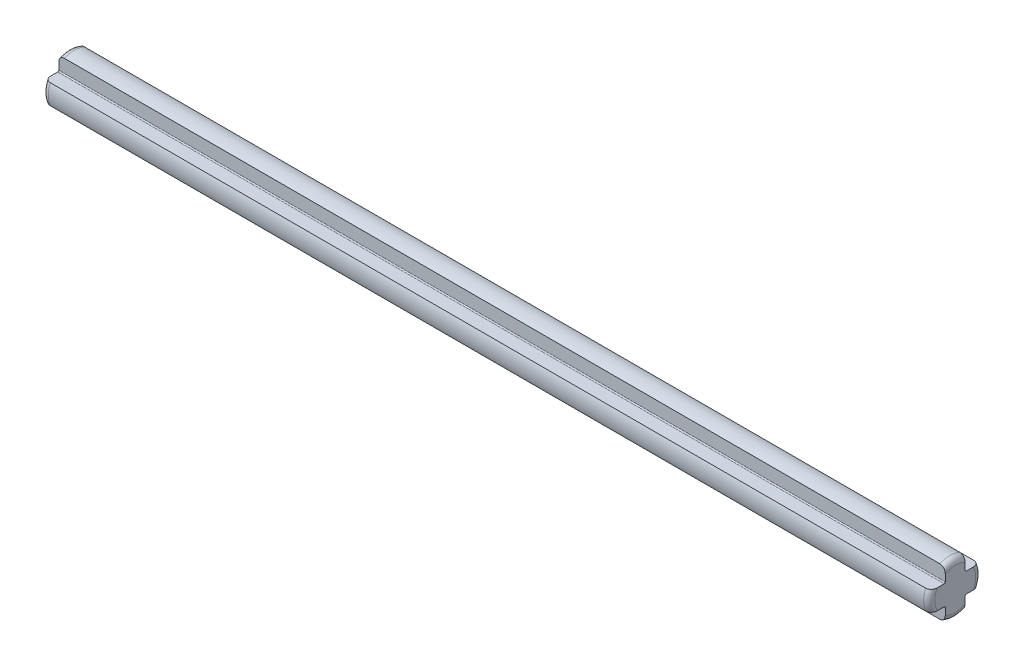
ISO-10303-21;
HEADER;
FILE_DESCRIPTION(('STEP AP214'),'2;1');
FILE_NAME('part.step','',(''),(''),'','','');
FILE_SCHEMA(('AUTOMOTIVE_DESIGN { 1 0 10303 214 1 1 1 1 }'));
ENDSEC;
DATA;
#1=APPLICATION_CONTEXT('core data for automotive mechanical design processes');
#2=APPLICATION_PROTOCOL_DEFINITION('international standard','automotive_design',2000,#1);
#3=PRODUCT_CONTEXT('',#1,'mechanical');
#4=PRODUCT('Part','Part','',(#3));
#5=PRODUCT_RELATED_PRODUCT_CATEGORY('part','',(#4));
#6=PRODUCT_DEFINITION_FORMATION('','',#4);
#7=PRODUCT_DEFINITION_CONTEXT('part definition',#1,'design');
#8=PRODUCT_DEFINITION('design','',#6,#7);
#9=PRODUCT_DEFINITION_SHAPE('','',#8);
#10=(LENGTH_UNIT() NAMED_UNIT(*) SI_UNIT(.MILLI.,.METRE.));
#11=(NAMED_UNIT(*) PLANE_ANGLE_UNIT() SI_UNIT($,.RADIAN.));
#12=(NAMED_UNIT(*) SI_UNIT($,.STERADIAN.) SOLID_ANGLE_UNIT());
#13=UNCERTAINTY_MEASURE_WITH_UNIT(LENGTH_MEASURE(1.E-05),#10,'distance_accuracy_value','');
#14=(GEOMETRIC_REPRESENTATION_CONTEXT(3) GLOBAL_UNCERTAINTY_ASSIGNED_CONTEXT((#13)) GLOBAL_UNIT_ASSIGNED_CONTEXT((#10,
#11,#12)) REPRESENTATION_CONTEXT('',''));
#15=CARTESIAN_POINT('',(0.,0.,0.));
#16=DIRECTION('',(0.,0.,1.));
#17=DIRECTION('',(1.,0.,0.));
#18=AXIS2_PLACEMENT_3D('',#15,#16,#17);
#19=CARTESIAN_POINT('',(40.,0.,0.));
#20=DIRECTION('',(-1.,0.,0.));
#21=DIRECTION('',(0.,0.,1.));
#22=AXIS2_PLACEMENT_3D('',#19,#20,#21);
#23=CYLINDRICAL_SURFACE('',#22,2.35);
#24=DIRECTION('',(-1.,0.,0.));
#25=VECTOR('',#24,1.);
#26=CARTESIAN_POINT('',(40.,0.9,2.17082933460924));
#27=LINE('',#26,#25);
#28=CARTESIAN_POINT('',(39.5,0.9,2.17082933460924));
#29=VERTEX_POINT('',#28);
#30=CARTESIAN_POINT('',(-39.5,0.9,2.17082933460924));
#31=VERTEX_POINT('',#30);
#32=EDGE_CURVE('E249',#29,#31,#27,.T.);
#33=ORIENTED_EDGE('',*,*,#32,.T.);
#34=CARTESIAN_POINT('',(-39.5,0.,0.));
#35=DIRECTION('',(1.,0.,0.));
#36=DIRECTION('',(0.,0.,-1.));
#37=AXIS2_PLACEMENT_3D('',#34,#35,#36);
#38=CIRCLE('',#37,2.35);
#39=CARTESIAN_POINT('',(-39.5,-0.900000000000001,2.17082933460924));
#40=VERTEX_POINT('',#39);
#41=EDGE_CURVE('E514',#31,#40,#38,.T.);
#42=ORIENTED_EDGE('',*,*,#41,.T.);
#43=DIRECTION('',(-1.,0.,0.));
#44=VECTOR('',#43,1.);
#45=CARTESIAN_POINT('',(40.,-0.900000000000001,2.17082933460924));
#46=LINE('',#45,#44);
#47=CARTESIAN_POINT('',(39.5,-0.900000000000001,2.17082933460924));
#48=VERTEX_POINT('',#47);
#49=EDGE_CURVE('E220',#48,#40,#46,.T.);
#50=ORIENTED_EDGE('',*,*,#49,.F.);
#51=CARTESIAN_POINT('',(39.5,0.,0.));
#52=DIRECTION('',(1.,0.,0.));
#53=DIRECTION('',(0.,0.,-1.));
#54=AXIS2_PLACEMENT_3D('',#51,#52,#53);
#55=CIRCLE('',#54,2.35);
#56=EDGE_CURVE('E369',#48,#29,#55,.F.);
#57=ORIENTED_EDGE('',*,*,#56,.T.);
#58=EDGE_LOOP('',(#33,#42,#50,#57));
#59=FACE_BOUND('',#58,.T.);
#60=ADVANCED_FACE('F36',(#59),#23,.T.);
#61=CARTESIAN_POINT('',(40.,-0.900000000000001,2.17082933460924));
#62=DIRECTION('',(0.,1.,0.));
#63=DIRECTION('',(0.,0.,1.));
#64=AXIS2_PLACEMENT_3D('',#61,#62,#63);
#65=PLANE('',#64);
#66=ORIENTED_EDGE('',*,*,#49,.T.);
#67=CARTESIAN_POINT('',(-39.5,-0.900000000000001,2.17082933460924));
#68=CARTESIAN_POINT('',(-39.5264833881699,-0.900000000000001,2.17085986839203));
#69=CARTESIAN_POINT('',(-39.5529498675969,-0.900000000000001,2.16855372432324));
#70=CARTESIAN_POINT('',(-39.6050453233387,-0.900000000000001,2.15950506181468));
#71=CARTESIAN_POINT('',(-39.6306762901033,-0.900000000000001,2.15277404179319));
#72=CARTESIAN_POINT('',(-39.6804387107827,-0.900000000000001,2.1351114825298));
#73=CARTESIAN_POINT('',(-39.7045703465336,-0.900000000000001,2.12418045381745));
#74=CARTESIAN_POINT('',(-39.7507251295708,-0.900000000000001,2.09852306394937));
#75=CARTESIAN_POINT('',(-39.7727475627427,-0.900000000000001,2.0837954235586));
#76=CARTESIAN_POINT('',(-39.8147234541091,-0.900000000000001,2.05060839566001));
#77=CARTESIAN_POINT('',(-39.8346070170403,-0.900000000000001,2.03206082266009));
#78=CARTESIAN_POINT('',(-39.8712243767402,-0.900000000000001,1.99209288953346));
#79=CARTESIAN_POINT('',(-39.8879579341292,-0.900000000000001,1.97067231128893));
#80=CARTESIAN_POINT('',(-39.9190973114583,-0.900000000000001,1.92396602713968));
#81=CARTESIAN_POINT('',(-39.9332527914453,-0.900000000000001,1.89851375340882));
#82=CARTESIAN_POINT('',(-39.9575247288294,-0.900000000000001,1.84573102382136));
#83=CARTESIAN_POINT('',(-39.9676367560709,-0.900000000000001,1.81839854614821));
#84=CARTESIAN_POINT('',(-39.9838866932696,-0.900000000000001,1.76219756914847));
#85=CARTESIAN_POINT('',(-39.9899702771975,-0.900000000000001,1.73331353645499));
#86=CARTESIAN_POINT('',(-39.9980270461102,-0.900000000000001,1.67505065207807));
#87=CARTESIAN_POINT('',(-40.0000109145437,-0.900000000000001,1.64567328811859));
#88=CARTESIAN_POINT('',(-40.,-0.900000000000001,1.61632298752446));
#89=B_SPLINE_CURVE_WITH_KNOTS('',3,(#67,#68,#69,#70,#71,#72,#73,#74,#75,#76,#77,#78,#79,#80,#81,
#82,#83,#84,#85,#86,#87,#88),.UNSPECIFIED.,.F.,.F.,(4,2,2,2,2,2,2,2,2,2,4),(0.,
0.0793238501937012,0.158442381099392,0.237551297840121,0.316686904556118,0.397909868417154,
0.479139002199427,0.566147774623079,0.653251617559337,0.74150740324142,0.829532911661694),.UNSPECIFIED.);
#90=CARTESIAN_POINT('',(-40.,-0.900000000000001,1.61632298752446));
#91=VERTEX_POINT('',#90);
#92=EDGE_CURVE('E389',#40,#91,#89,.T.);
#93=ORIENTED_EDGE('',*,*,#92,.T.);
#94=DIRECTION('',(0.,0.,-1.));
#95=VECTOR('',#94,1.);
#96=CARTESIAN_POINT('',(-40.,-0.900000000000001,2.17082933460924));
#97=LINE('',#96,#95);
#98=CARTESIAN_POINT('',(-40.,-0.900000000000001,0.999999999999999));
#99=VERTEX_POINT('',#98);
#100=EDGE_CURVE('E217',#91,#99,#97,.T.);
#101=ORIENTED_EDGE('',*,*,#100,.T.);
#102=DIRECTION('',(-1.,0.,0.));
#103=VECTOR('',#102,1.);
#104=CARTESIAN_POINT('',(40.,-0.900000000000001,0.999999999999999));
#105=LINE('',#104,#103);
#106=CARTESIAN_POINT('',(40.,-0.900000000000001,0.999999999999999));
#107=VERTEX_POINT('',#106);
#108=EDGE_CURVE('E213',#107,#99,#105,.T.);
#109=ORIENTED_EDGE('',*,*,#108,.F.);
#110=DIRECTION('',(0.,0.,-1.));
#111=VECTOR('',#110,1.);
#112=CARTESIAN_POINT('',(40.,-0.900000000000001,2.17082933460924));
#113=LINE('',#112,#111);
#114=CARTESIAN_POINT('',(40.,-0.900000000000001,1.61632298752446));
#115=VERTEX_POINT('',#114);
#116=EDGE_CURVE('E200',#115,#107,#113,.T.);
#117=ORIENTED_EDGE('',*,*,#116,.F.);
#118=CARTESIAN_POINT('',(40.,-0.900000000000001,1.61632298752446));
#119=CARTESIAN_POINT('',(40.0000222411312,-0.900000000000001,1.65066661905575));
#120=CARTESIAN_POINT('',(39.9972983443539,-0.900000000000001,1.68506058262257));
#121=CARTESIAN_POINT('',(39.9862156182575,-0.900000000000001,1.75308687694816));
#122=CARTESIAN_POINT('',(39.9778303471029,-0.900000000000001,1.78671486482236));
#123=CARTESIAN_POINT('',(39.9552419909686,-0.900000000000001,1.85211366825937));
#124=CARTESIAN_POINT('',(39.9410195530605,-0.900000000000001,1.88387790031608));
#125=CARTESIAN_POINT('',(39.9069131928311,-0.900000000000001,1.94414749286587));
#126=CARTESIAN_POINT('',(39.8870416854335,-0.900000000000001,1.97265980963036));
#127=CARTESIAN_POINT('',(39.844222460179,-0.900000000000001,2.02268935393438));
#128=CARTESIAN_POINT('',(39.8217526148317,-0.900000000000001,2.04461521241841));
#129=CARTESIAN_POINT('',(39.7730890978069,-0.900000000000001,2.08389547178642));
#130=CARTESIAN_POINT('',(39.7468952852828,-0.900000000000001,2.10124969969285));
#131=CARTESIAN_POINT('',(39.6943438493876,-0.900000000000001,2.12912089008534));
#132=CARTESIAN_POINT('',(39.6682509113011,-0.900000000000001,2.14013932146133));
#133=CARTESIAN_POINT('',(39.6145341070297,-0.900000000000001,2.15730052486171));
#134=CARTESIAN_POINT('',(39.586913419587,-0.900000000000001,2.1634530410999));
#135=CARTESIAN_POINT('',(39.5492135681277,-0.900000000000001,2.16830749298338));
#136=CARTESIAN_POINT('',(39.5393866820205,-0.900000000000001,2.1692533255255));
#137=CARTESIAN_POINT('',(39.5197081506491,-0.900000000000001,2.17051341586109));
#138=CARTESIAN_POINT('',(39.5098565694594,-0.900000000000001,2.17082867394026));
#139=CARTESIAN_POINT('',(39.5,-0.900000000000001,2.17082933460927));
#140=B_SPLINE_CURVE_WITH_KNOTS('',3,(#118,#119,#120,#121,#122,#123,#124,#125,#126,#127,#128,
#129,#130,#131,#132,#133,#134,#135,#136,#137,#138,#139),.UNSPECIFIED.,.F.,.F.,(4,2,2,2,2,2,2,2,
2,2,4),(0.,0.103000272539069,0.206484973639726,0.310315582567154,0.413919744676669,
0.507586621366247,0.601257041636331,0.685799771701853,0.770172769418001,0.799774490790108,
0.829329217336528),.UNSPECIFIED.);
#141=EDGE_CURVE('E519',#115,#48,#140,.T.);
#142=ORIENTED_EDGE('',*,*,#141,.T.);
#143=EDGE_LOOP('',(#66,#93,#101,#109,#117,#142));
#144=FACE_BOUND('',#143,.T.);
#145=ADVANCED_FACE('F215',(#144),#65,.F.);
#146=CARTESIAN_POINT('',(40.,-1.,0.999999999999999));
#147=DIRECTION('',(-1.,0.,0.));
#148=DIRECTION('',(0.,0.,1.));
#149=AXIS2_PLACEMENT_3D('',#146,#147,#148);
#150=CYLINDRICAL_SURFACE('',#149,0.0999999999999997);
#151=CARTESIAN_POINT('',(-40.,-1.,0.999999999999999));
#152=DIRECTION('',(-1.,0.,0.));
#153=DIRECTION('',(0.,0.,1.));
#154=AXIS2_PLACEMENT_3D('',#151,#152,#153);
#155=CIRCLE('',#154,0.0999999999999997);
#156=CARTESIAN_POINT('',(-40.,-1.,0.899999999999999));
#157=VERTEX_POINT('',#156);
#158=EDGE_CURVE('E251',#99,#157,#155,.T.);
#159=ORIENTED_EDGE('',*,*,#158,.T.);
#160=DIRECTION('',(-1.,0.,0.));
#161=VECTOR('',#160,1.);
#162=CARTESIAN_POINT('',(40.,-1.,0.899999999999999));
#163=LINE('',#162,#161);
#164=CARTESIAN_POINT('',(40.,-1.,0.899999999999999));
#165=VERTEX_POINT('',#164);
#166=EDGE_CURVE('E221',#165,#157,#163,.T.);
#167=ORIENTED_EDGE('',*,*,#166,.F.);
#168=CARTESIAN_POINT('',(40.,-1.,0.999999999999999));
#169=DIRECTION('',(-1.,0.,0.));
#170=DIRECTION('',(0.,0.,1.));
#171=AXIS2_PLACEMENT_3D('',#168,#169,#170);
#172=CIRCLE('',#171,0.0999999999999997);
#173=EDGE_CURVE('E206',#107,#165,#172,.T.);
#174=ORIENTED_EDGE('',*,*,#173,.F.);
#175=ORIENTED_EDGE('',*,*,#108,.T.);
#176=EDGE_LOOP('',(#159,#167,#174,#175));
#177=FACE_BOUND('',#176,.T.);
#178=ADVANCED_FACE('F223',(#177),#150,.F.);
#179=CARTESIAN_POINT('',(40.,-2.17082933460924,0.899999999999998));
#180=DIRECTION('',(0.,0.,-1.));
#181=DIRECTION('',(0.,1.,0.));
#182=AXIS2_PLACEMENT_3D('',#179,#180,#181);
#183=PLANE('',#182);
#184=DIRECTION('',(0.,-1.,0.));
#185=VECTOR('',#184,1.);
#186=CARTESIAN_POINT('',(-40.,-2.17082933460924,0.899999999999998));
#187=LINE('',#186,#185);
#188=CARTESIAN_POINT('',(-40.,-1.61632298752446,0.899999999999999));
#189=VERTEX_POINT('',#188);
#190=EDGE_CURVE('E253',#157,#189,#187,.T.);
#191=ORIENTED_EDGE('',*,*,#190,.T.);
#192=CARTESIAN_POINT('',(-40.,-1.61632298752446,0.899999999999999));
#193=CARTESIAN_POINT('',(-40.0000222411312,-1.65066661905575,0.899999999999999));
#194=CARTESIAN_POINT('',(-39.9972983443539,-1.68506058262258,0.899999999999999));
#195=CARTESIAN_POINT('',(-39.9862156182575,-1.75308687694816,0.899999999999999));
#196=CARTESIAN_POINT('',(-39.9778303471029,-1.78671486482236,0.899999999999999));
#197=CARTESIAN_POINT('',(-39.9552419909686,-1.85211366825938,0.899999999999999));
#198=CARTESIAN_POINT('',(-39.9410195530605,-1.88387790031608,0.899999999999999));
#199=CARTESIAN_POINT('',(-39.9069131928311,-1.94414749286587,0.899999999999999));
#200=CARTESIAN_POINT('',(-39.8870416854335,-1.97265980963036,0.899999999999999));
#201=CARTESIAN_POINT('',(-39.844222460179,-2.02268935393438,0.899999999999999));
#202=CARTESIAN_POINT('',(-39.8217526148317,-2.04461521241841,0.899999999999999));
#203=CARTESIAN_POINT('',(-39.7730890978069,-2.08389547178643,0.899999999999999));
#204=CARTESIAN_POINT('',(-39.7468952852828,-2.10124969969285,0.899999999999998));
#205=CARTESIAN_POINT('',(-39.6943438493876,-2.12912089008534,0.899999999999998));
#206=CARTESIAN_POINT('',(-39.6682509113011,-2.14013932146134,0.899999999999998));
#207=CARTESIAN_POINT('',(-39.6145341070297,-2.15730052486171,0.899999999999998));
#208=CARTESIAN_POINT('',(-39.586913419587,-2.1634530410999,0.899999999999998));
#209=CARTESIAN_POINT('',(-39.5492135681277,-2.16830749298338,0.899999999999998));
#210=CARTESIAN_POINT('',(-39.5393866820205,-2.1692533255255,0.899999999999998));
#211=CARTESIAN_POINT('',(-39.5197081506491,-2.17051341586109,0.899999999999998));
#212=CARTESIAN_POINT('',(-39.5098565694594,-2.17082867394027,0.899999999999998));
#213=CARTESIAN_POINT('',(-39.5,-2.17082933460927,0.899999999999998));
#214=B_SPLINE_CURVE_WITH_KNOTS('',3,(#192,#193,#194,#195,#196,#197,#198,#199,#200,#201,#202,
#203,#204,#205,#206,#207,#208,#209,#210,#211,#212,#213),.UNSPECIFIED.,.F.,.F.,(4,2,2,2,2,2,2,2,
2,2,4),(0.,0.10300027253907,0.206484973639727,0.310315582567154,0.413919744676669,
0.507586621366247,0.601257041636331,0.685799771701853,0.770172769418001,0.799774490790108,
0.829329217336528),.UNSPECIFIED.);
#215=CARTESIAN_POINT('',(-39.5,-2.17082933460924,0.899999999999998));
#216=VERTEX_POINT('',#215);
#217=EDGE_CURVE('E364',#189,#216,#214,.T.);
#218=ORIENTED_EDGE('',*,*,#217,.T.);
#219=DIRECTION('',(-1.,0.,0.));
#220=VECTOR('',#219,1.);
#221=CARTESIAN_POINT('',(40.,-2.17082933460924,0.899999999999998));
#222=LINE('',#221,#220);
#223=CARTESIAN_POINT('',(39.5,-2.17082933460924,0.899999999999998));
#224=VERTEX_POINT('',#223);
#225=EDGE_CURVE('E311',#224,#216,#222,.T.);
#226=ORIENTED_EDGE('',*,*,#225,.F.);
#227=CARTESIAN_POINT('',(39.5,-2.17082933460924,0.899999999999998));
#228=CARTESIAN_POINT('',(39.5264833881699,-2.17085986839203,0.899999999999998));
#229=CARTESIAN_POINT('',(39.5529498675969,-2.16855372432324,0.899999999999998));
#230=CARTESIAN_POINT('',(39.6050453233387,-2.15950506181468,0.899999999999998));
#231=CARTESIAN_POINT('',(39.6306762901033,-2.15277404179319,0.899999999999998));
#232=CARTESIAN_POINT('',(39.6804387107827,-2.1351114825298,0.899999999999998));
#233=CARTESIAN_POINT('',(39.7045703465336,-2.12418045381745,0.899999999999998));
#234=CARTESIAN_POINT('',(39.7507251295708,-2.09852306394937,0.899999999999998));
#235=CARTESIAN_POINT('',(39.7727475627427,-2.0837954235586,0.899999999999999));
#236=CARTESIAN_POINT('',(39.8147234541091,-2.05060839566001,0.899999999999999));
#237=CARTESIAN_POINT('',(39.8346070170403,-2.03206082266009,0.899999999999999));
#238=CARTESIAN_POINT('',(39.8712243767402,-1.99209288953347,0.899999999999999));
#239=CARTESIAN_POINT('',(39.8879579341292,-1.97067231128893,0.899999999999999));
#240=CARTESIAN_POINT('',(39.9190973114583,-1.92396602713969,0.899999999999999));
#241=CARTESIAN_POINT('',(39.9332527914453,-1.89851375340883,0.899999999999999));
#242=CARTESIAN_POINT('',(39.9575247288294,-1.84573102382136,0.899999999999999));
#243=CARTESIAN_POINT('',(39.9676367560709,-1.81839854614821,0.899999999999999));
#244=CARTESIAN_POINT('',(39.9838866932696,-1.76219756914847,0.899999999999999));
#245=CARTESIAN_POINT('',(39.9899702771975,-1.733313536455,0.899999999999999));
#246=CARTESIAN_POINT('',(39.9980270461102,-1.67505065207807,0.899999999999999));
#247=CARTESIAN_POINT('',(40.0000109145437,-1.64567328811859,0.899999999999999));
#248=CARTESIAN_POINT('',(40.,-1.61632298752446,0.899999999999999));
#249=B_SPLINE_CURVE_WITH_KNOTS('',3,(#227,#228,#229,#230,#231,#232,#233,#234,#235,#236,#237,
#238,#239,#240,#241,#242,#243,#244,#245,#246,#247,#248),.UNSPECIFIED.,.F.,.F.,(4,2,2,2,2,2,2,2,
2,2,4),(0.,0.0793238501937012,0.158442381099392,0.237551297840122,0.316686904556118,
0.397909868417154,0.479139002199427,0.566147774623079,0.653251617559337,0.74150740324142,
0.829532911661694),.UNSPECIFIED.);
#250=CARTESIAN_POINT('',(40.,-1.61632298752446,0.899999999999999));
#251=VERTEX_POINT('',#250);
#252=EDGE_CURVE('E358',#224,#251,#249,.T.);
#253=ORIENTED_EDGE('',*,*,#252,.T.);
#254=DIRECTION('',(0.,-1.,0.));
#255=VECTOR('',#254,1.);
#256=CARTESIAN_POINT('',(40.,-2.17082933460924,0.899999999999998));
#257=LINE('',#256,#255);
#258=EDGE_CURVE('E226',#165,#251,#257,.T.);
#259=ORIENTED_EDGE('',*,*,#258,.F.);
#260=ORIENTED_EDGE('',*,*,#166,.T.);
#261=EDGE_LOOP('',(#191,#218,#226,#253,#259,#260));
#262=FACE_BOUND('',#261,.T.);
#263=ADVANCED_FACE('F349',(#262),#183,.F.);
#264=CARTESIAN_POINT('',(40.,0.,0.));
#265=DIRECTION('',(-1.,0.,0.));
#266=DIRECTION('',(0.,0.,1.));
#267=AXIS2_PLACEMENT_3D('',#264,#265,#266);
#268=CYLINDRICAL_SURFACE('',#267,2.35);
#269=ORIENTED_EDGE('',*,*,#225,.T.);
#270=CARTESIAN_POINT('',(-39.5,0.,0.));
#271=DIRECTION('',(1.,0.,0.));
#272=DIRECTION('',(0.,0.,-1.));
#273=AXIS2_PLACEMENT_3D('',#270,#271,#272);
#274=CIRCLE('',#273,2.35);
#275=CARTESIAN_POINT('',(-39.5,-2.17082933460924,-0.9));
#276=VERTEX_POINT('',#275);
#277=EDGE_CURVE('E318',#216,#276,#274,.T.);
#278=ORIENTED_EDGE('',*,*,#277,.T.);
#279=DIRECTION('',(-1.,0.,0.));
#280=VECTOR('',#279,1.);
#281=CARTESIAN_POINT('',(40.,-2.17082933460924,-0.9));
#282=LINE('',#281,#280);
#283=CARTESIAN_POINT('',(39.5,-2.17082933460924,-0.9));
#284=VERTEX_POINT('',#283);
#285=EDGE_CURVE('E308',#284,#276,#282,.T.);
#286=ORIENTED_EDGE('',*,*,#285,.F.);
#287=CARTESIAN_POINT('',(39.5,0.,0.));
#288=DIRECTION('',(1.,0.,0.));
#289=DIRECTION('',(0.,0.,-1.));
#290=AXIS2_PLACEMENT_3D('',#287,#288,#289);
#291=CIRCLE('',#290,2.35);
#292=EDGE_CURVE('E316',#284,#224,#291,.F.);
#293=ORIENTED_EDGE('',*,*,#292,.T.);
#294=EDGE_LOOP('',(#269,#278,#286,#293));
#295=FACE_BOUND('',#294,.T.);
#296=ADVANCED_FACE('F343',(#295),#268,.T.);
#297=CARTESIAN_POINT('',(40.,-2.17082933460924,-0.9));
#298=DIRECTION('',(0.,0.,1.));
#299=DIRECTION('',(0.,-1.,0.));
#300=AXIS2_PLACEMENT_3D('',#297,#298,#299);
#301=PLANE('',#300);
#302=ORIENTED_EDGE('',*,*,#285,.T.);
#303=CARTESIAN_POINT('',(-39.5,-2.17082933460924,-0.9));
#304=CARTESIAN_POINT('',(-39.5264833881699,-2.17085986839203,-0.9));
#305=CARTESIAN_POINT('',(-39.5529498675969,-2.16855372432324,-0.9));
#306=CARTESIAN_POINT('',(-39.6050453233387,-2.15950506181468,-0.9));
#307=CARTESIAN_POINT('',(-39.6306762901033,-2.15277404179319,-0.9));
#308=CARTESIAN_POINT('',(-39.6804387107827,-2.1351114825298,-0.9));
#309=CARTESIAN_POINT('',(-39.7045703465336,-2.12418045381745,-0.9));
#310=CARTESIAN_POINT('',(-39.7507251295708,-2.09852306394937,-0.9));
#311=CARTESIAN_POINT('',(-39.7727475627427,-2.0837954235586,-0.9));
#312=CARTESIAN_POINT('',(-39.8147234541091,-2.05060839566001,-0.9));
#313=CARTESIAN_POINT('',(-39.8346070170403,-2.03206082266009,-0.9));
#314=CARTESIAN_POINT('',(-39.8712243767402,-1.99209288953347,-0.9));
#315=CARTESIAN_POINT('',(-39.8879579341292,-1.97067231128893,-0.9));
#316=CARTESIAN_POINT('',(-39.9190973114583,-1.92396602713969,-0.9));
#317=CARTESIAN_POINT('',(-39.9332527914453,-1.89851375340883,-0.9));
#318=CARTESIAN_POINT('',(-39.9575247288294,-1.84573102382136,-0.9));
#319=CARTESIAN_POINT('',(-39.9676367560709,-1.81839854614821,-0.9));
#320=CARTESIAN_POINT('',(-39.9838866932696,-1.76219756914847,-0.9));
#321=CARTESIAN_POINT('',(-39.9899702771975,-1.73331353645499,-0.9));
#322=CARTESIAN_POINT('',(-39.9980270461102,-1.67505065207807,-0.9));
#323=CARTESIAN_POINT('',(-40.0000109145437,-1.64567328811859,-0.9));
#324=CARTESIAN_POINT('',(-40.,-1.61632298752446,-0.9));
#325=B_SPLINE_CURVE_WITH_KNOTS('',3,(#303,#304,#305,#306,#307,#308,#309,#310,#311,#312,#313,
#314,#315,#316,#317,#318,#319,#320,#321,#322,#323,#324),.UNSPECIFIED.,.F.,.F.,(4,2,2,2,2,2,2,2,
2,2,4),(0.,0.0793238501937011,0.158442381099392,0.237551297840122,0.316686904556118,
0.397909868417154,0.479139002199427,0.566147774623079,0.653251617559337,0.74150740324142,
0.829532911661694),.UNSPECIFIED.);
#326=CARTESIAN_POINT('',(-40.,-1.61632298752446,-0.9));
#327=VERTEX_POINT('',#326);
#328=EDGE_CURVE('E328',#276,#327,#325,.T.);
#329=ORIENTED_EDGE('',*,*,#328,.T.);
#330=DIRECTION('',(0.,1.,0.));
#331=VECTOR('',#330,1.);
#332=CARTESIAN_POINT('',(-40.,-2.17082933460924,-0.9));
#333=LINE('',#332,#331);
#334=CARTESIAN_POINT('',(-40.,-1.,-0.9));
#335=VERTEX_POINT('',#334);
#336=EDGE_CURVE('E256',#327,#335,#333,.T.);
#337=ORIENTED_EDGE('',*,*,#336,.T.);
#338=DIRECTION('',(-1.,0.,0.));
#339=VECTOR('',#338,1.);
#340=CARTESIAN_POINT('',(40.,-1.,-0.9));
#341=LINE('',#340,#339);
#342=CARTESIAN_POINT('',(40.,-1.,-0.9));
#343=VERTEX_POINT('',#342);
#344=EDGE_CURVE('E305',#343,#335,#341,.T.);
#345=ORIENTED_EDGE('',*,*,#344,.F.);
#346=DIRECTION('',(0.,1.,0.));
#347=VECTOR('',#346,1.);
#348=CARTESIAN_POINT('',(40.,-2.17082933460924,-0.9));
#349=LINE('',#348,#347);
#350=CARTESIAN_POINT('',(40.,-1.61632298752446,-0.9));
#351=VERTEX_POINT('',#350);
#352=EDGE_CURVE('E228',#351,#343,#349,.T.);
#353=ORIENTED_EDGE('',*,*,#352,.F.);
#354=CARTESIAN_POINT('',(40.,-1.61632298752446,-0.9));
#355=CARTESIAN_POINT('',(40.0000222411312,-1.65066661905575,-0.9));
#356=CARTESIAN_POINT('',(39.9972983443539,-1.68506058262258,-0.9));
#357=CARTESIAN_POINT('',(39.9862156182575,-1.75308687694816,-0.9));
#358=CARTESIAN_POINT('',(39.9778303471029,-1.78671486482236,-0.9));
#359=CARTESIAN_POINT('',(39.9552419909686,-1.85211366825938,-0.9));
#360=CARTESIAN_POINT('',(39.9410195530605,-1.88387790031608,-0.9));
#361=CARTESIAN_POINT('',(39.9069131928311,-1.94414749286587,-0.9));
#362=CARTESIAN_POINT('',(39.8870416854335,-1.97265980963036,-0.9));
#363=CARTESIAN_POINT('',(39.844222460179,-2.02268935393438,-0.9));
#364=CARTESIAN_POINT('',(39.8217526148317,-2.04461521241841,-0.9));
#365=CARTESIAN_POINT('',(39.7730890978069,-2.08389547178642,-0.9));
#366=CARTESIAN_POINT('',(39.7468952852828,-2.10124969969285,-0.9));
#367=CARTESIAN_POINT('',(39.6943438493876,-2.12912089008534,-0.9));
#368=CARTESIAN_POINT('',(39.6682509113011,-2.14013932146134,-0.9));
#369=CARTESIAN_POINT('',(39.6145341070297,-2.15730052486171,-0.9));
#370=CARTESIAN_POINT('',(39.586913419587,-2.1634530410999,-0.9));
#371=CARTESIAN_POINT('',(39.5492135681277,-2.16830749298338,-0.9));
#372=CARTESIAN_POINT('',(39.5393866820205,-2.1692533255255,-0.9));
#373=CARTESIAN_POINT('',(39.5197081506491,-2.17051341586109,-0.9));
#374=CARTESIAN_POINT('',(39.5098565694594,-2.17082867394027,-0.9));
#375=CARTESIAN_POINT('',(39.5,-2.17082933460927,-0.9));
#376=B_SPLINE_CURVE_WITH_KNOTS('',3,(#354,#355,#356,#357,#358,#359,#360,#361,#362,#363,#364,
#365,#366,#367,#368,#369,#370,#371,#372,#373,#374,#375),.UNSPECIFIED.,.F.,.F.,(4,2,2,2,2,2,2,2,
2,2,4),(0.,0.103000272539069,0.206484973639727,0.310315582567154,0.413919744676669,
0.507586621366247,0.601257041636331,0.685799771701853,0.770172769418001,0.799774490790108,
0.829329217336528),.UNSPECIFIED.);
#377=EDGE_CURVE('E321',#351,#284,#376,.T.);
#378=ORIENTED_EDGE('',*,*,#377,.T.);
#379=EDGE_LOOP('',(#302,#329,#337,#345,#353,#378));
#380=FACE_BOUND('',#379,.T.);
#381=ADVANCED_FACE('F337',(#380),#301,.F.);
#382=CARTESIAN_POINT('',(40.,-1.,-1.));
#383=DIRECTION('',(-1.,0.,0.));
#384=DIRECTION('',(0.,0.,1.));
#385=AXIS2_PLACEMENT_3D('',#382,#383,#384);
#386=CYLINDRICAL_SURFACE('',#385,0.0999999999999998);
#387=CARTESIAN_POINT('',(-40.,-1.,-1.));
#388=DIRECTION('',(-1.,0.,0.));
#389=DIRECTION('',(0.,0.,-1.));
#390=AXIS2_PLACEMENT_3D('',#387,#388,#389);
#391=CIRCLE('',#390,0.0999999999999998);
#392=CARTESIAN_POINT('',(-40.,-0.9,-1.));
#393=VERTEX_POINT('',#392);
#394=EDGE_CURVE('E258',#335,#393,#391,.T.);
#395=ORIENTED_EDGE('',*,*,#394,.T.);
#396=DIRECTION('',(-1.,0.,0.));
#397=VECTOR('',#396,1.);
#398=CARTESIAN_POINT('',(40.,-0.9,-1.));
#399=LINE('',#398,#397);
#400=CARTESIAN_POINT('',(40.,-0.9,-1.));
#401=VERTEX_POINT('',#400);
#402=EDGE_CURVE('E302',#401,#393,#399,.T.);
#403=ORIENTED_EDGE('',*,*,#402,.F.);
#404=CARTESIAN_POINT('',(40.,-1.,-1.));
#405=DIRECTION('',(-1.,0.,0.));
#406=DIRECTION('',(0.,0.,-1.));
#407=AXIS2_PLACEMENT_3D('',#404,#405,#406);
#408=CIRCLE('',#407,0.0999999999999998);
#409=EDGE_CURVE('E232',#343,#401,#408,.T.);
#410=ORIENTED_EDGE('',*,*,#409,.F.);
#411=ORIENTED_EDGE('',*,*,#344,.T.);
#412=EDGE_LOOP('',(#395,#403,#410,#411));
#413=FACE_BOUND('',#412,.T.);
#414=ADVANCED_FACE('F342',(#413),#386,.F.);
#415=CARTESIAN_POINT('',(40.,-0.900000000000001,-2.17082933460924));
#416=DIRECTION('',(0.,1.,0.));
#417=DIRECTION('',(0.,0.,1.));
#418=AXIS2_PLACEMENT_3D('',#415,#416,#417);
#419=PLANE('',#418);
#420=DIRECTION('',(0.,0.,-1.));
#421=VECTOR('',#420,1.);
#422=CARTESIAN_POINT('',(-40.,-0.900000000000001,-2.17082933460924));
#423=LINE('',#422,#421);
#424=CARTESIAN_POINT('',(-40.,-0.9,-1.61632298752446));
#425=VERTEX_POINT('',#424);
#426=EDGE_CURVE('E260',#393,#425,#423,.T.);
#427=ORIENTED_EDGE('',*,*,#426,.T.);
#428=CARTESIAN_POINT('',(-40.,-0.9,-1.61632298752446));
#429=CARTESIAN_POINT('',(-40.0000222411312,-0.9,-1.65066661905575));
#430=CARTESIAN_POINT('',(-39.9972983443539,-0.9,-1.68506058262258));
#431=CARTESIAN_POINT('',(-39.9862156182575,-0.9,-1.75308687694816));
#432=CARTESIAN_POINT('',(-39.9778303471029,-0.9,-1.78671486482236));
#433=CARTESIAN_POINT('',(-39.9552419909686,-0.9,-1.85211366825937));
#434=CARTESIAN_POINT('',(-39.9410195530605,-0.9,-1.88387790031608));
#435=CARTESIAN_POINT('',(-39.9069131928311,-0.9,-1.94414749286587));
#436=CARTESIAN_POINT('',(-39.8870416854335,-0.9,-1.97265980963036));
#437=CARTESIAN_POINT('',(-39.844222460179,-0.9,-2.02268935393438));
#438=CARTESIAN_POINT('',(-39.8217526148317,-0.900000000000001,-2.04461521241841));
#439=CARTESIAN_POINT('',(-39.7730890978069,-0.900000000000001,-2.08389547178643));
#440=CARTESIAN_POINT('',(-39.7468952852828,-0.900000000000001,-2.10124969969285));
#441=CARTESIAN_POINT('',(-39.6943438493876,-0.900000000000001,-2.12912089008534));
#442=CARTESIAN_POINT('',(-39.6682509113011,-0.900000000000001,-2.14013932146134));
#443=CARTESIAN_POINT('',(-39.6145341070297,-0.900000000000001,-2.15730052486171));
#444=CARTESIAN_POINT('',(-39.586913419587,-0.900000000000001,-2.1634530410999));
#445=CARTESIAN_POINT('',(-39.5492135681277,-0.900000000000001,-2.16830749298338));
#446=CARTESIAN_POINT('',(-39.5393866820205,-0.900000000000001,-2.1692533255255));
#447=CARTESIAN_POINT('',(-39.5197081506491,-0.900000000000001,-2.17051341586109));
#448=CARTESIAN_POINT('',(-39.5098565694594,-0.900000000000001,-2.17082867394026));
#449=CARTESIAN_POINT('',(-39.5,-0.900000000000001,-2.17082933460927));
#450=B_SPLINE_CURVE_WITH_KNOTS('',3,(#428,#429,#430,#431,#432,#433,#434,#435,#436,#437,#438,
#439,#440,#441,#442,#443,#444,#445,#446,#447,#448,#449),.UNSPECIFIED.,.F.,.F.,(4,2,2,2,2,2,2,2,
2,2,4),(0.,0.10300027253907,0.206484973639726,0.310315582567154,0.413919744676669,
0.507586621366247,0.601257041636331,0.685799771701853,0.770172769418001,0.799774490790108,
0.829329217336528),.UNSPECIFIED.);
#451=CARTESIAN_POINT('',(-39.5,-0.9,-2.17082933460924));
#452=VERTEX_POINT('',#451);
#453=EDGE_CURVE('E488',#425,#452,#450,.T.);
#454=ORIENTED_EDGE('',*,*,#453,.T.);
#455=DIRECTION('',(-1.,0.,0.));
#456=VECTOR('',#455,1.);
#457=CARTESIAN_POINT('',(40.,-0.9,-2.17082933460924));
#458=LINE('',#457,#456);
#459=CARTESIAN_POINT('',(39.5,-0.9,-2.17082933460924));
#460=VERTEX_POINT('',#459);
#461=EDGE_CURVE('E299',#460,#452,#458,.T.);
#462=ORIENTED_EDGE('',*,*,#461,.F.);
#463=CARTESIAN_POINT('',(39.5,-0.9,-2.17082933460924));
#464=CARTESIAN_POINT('',(39.5264833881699,-0.9,-2.17085986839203));
#465=CARTESIAN_POINT('',(39.5529498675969,-0.900000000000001,-2.16855372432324));
#466=CARTESIAN_POINT('',(39.6050453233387,-0.900000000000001,-2.15950506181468));
#467=CARTESIAN_POINT('',(39.6306762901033,-0.900000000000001,-2.15277404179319));
#468=CARTESIAN_POINT('',(39.6804387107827,-0.900000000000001,-2.1351114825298));
#469=CARTESIAN_POINT('',(39.7045703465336,-0.900000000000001,-2.12418045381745));
#470=CARTESIAN_POINT('',(39.7507251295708,-0.900000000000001,-2.09852306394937));
#471=CARTESIAN_POINT('',(39.7727475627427,-0.900000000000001,-2.0837954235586));
#472=CARTESIAN_POINT('',(39.8147234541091,-0.900000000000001,-2.05060839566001));
#473=CARTESIAN_POINT('',(39.8346070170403,-0.9,-2.03206082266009));
#474=CARTESIAN_POINT('',(39.8712243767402,-0.9,-1.99209288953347));
#475=CARTESIAN_POINT('',(39.8879579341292,-0.9,-1.97067231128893));
#476=CARTESIAN_POINT('',(39.9190973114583,-0.9,-1.92396602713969));
#477=CARTESIAN_POINT('',(39.9332527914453,-0.9,-1.89851375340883));
#478=CARTESIAN_POINT('',(39.9575247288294,-0.9,-1.84573102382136));
#479=CARTESIAN_POINT('',(39.9676367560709,-0.9,-1.81839854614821));
#480=CARTESIAN_POINT('',(39.9838866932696,-0.9,-1.76219756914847));
#481=CARTESIAN_POINT('',(39.9899702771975,-0.9,-1.73331353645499));
#482=CARTESIAN_POINT('',(39.9980270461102,-0.9,-1.67505065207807));
#483=CARTESIAN_POINT('',(40.0000109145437,-0.9,-1.64567328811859));
#484=CARTESIAN_POINT('',(40.,-0.9,-1.61632298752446));
#485=B_SPLINE_CURVE_WITH_KNOTS('',3,(#463,#464,#465,#466,#467,#468,#469,#470,#471,#472,#473,
#474,#475,#476,#477,#478,#479,#480,#481,#482,#483,#484),.UNSPECIFIED.,.F.,.F.,(4,2,2,2,2,2,2,2,
2,2,4),(0.,0.0793238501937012,0.158442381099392,0.237551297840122,0.316686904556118,
0.397909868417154,0.479139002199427,0.566147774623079,0.653251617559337,0.74150740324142,
0.829532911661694),.UNSPECIFIED.);
#486=CARTESIAN_POINT('',(40.,-0.9,-1.61632298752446));
#487=VERTEX_POINT('',#486);
#488=EDGE_CURVE('E52',#460,#487,#485,.T.);
#489=ORIENTED_EDGE('',*,*,#488,.T.);
#490=DIRECTION('',(0.,0.,-1.));
#491=VECTOR('',#490,1.);
#492=CARTESIAN_POINT('',(40.,-0.900000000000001,-2.17082933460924));
#493=LINE('',#492,#491);
#494=EDGE_CURVE('E234',#401,#487,#493,.T.);
#495=ORIENTED_EDGE('',*,*,#494,.F.);
#496=ORIENTED_EDGE('',*,*,#402,.T.);
#497=EDGE_LOOP('',(#427,#454,#462,#489,#495,#496));
#498=FACE_BOUND('',#497,.T.);
#499=ADVANCED_FACE('F495',(#498),#419,.F.);
#500=CARTESIAN_POINT('',(40.,0.,0.));
#501=DIRECTION('',(-1.,0.,0.));
#502=DIRECTION('',(0.,0.,1.));
#503=AXIS2_PLACEMENT_3D('',#500,#501,#502);
#504=CYLINDRICAL_SURFACE('',#503,2.35);
#505=ORIENTED_EDGE('',*,*,#461,.T.);
#506=CARTESIAN_POINT('',(-39.5,0.,0.));
#507=DIRECTION('',(1.,0.,0.));
#508=DIRECTION('',(0.,0.,-1.));
#509=AXIS2_PLACEMENT_3D('',#506,#507,#508);
#510=CIRCLE('',#509,2.35);
#511=CARTESIAN_POINT('',(-39.5,0.900000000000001,-2.17082933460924));
#512=VERTEX_POINT('',#511);
#513=EDGE_CURVE('E574',#452,#512,#510,.T.);
#514=ORIENTED_EDGE('',*,*,#513,.T.);
#515=DIRECTION('',(-1.,0.,0.));
#516=VECTOR('',#515,1.);
#517=CARTESIAN_POINT('',(40.,0.900000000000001,-2.17082933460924));
#518=LINE('',#517,#516);
#519=CARTESIAN_POINT('',(39.5,0.900000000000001,-2.17082933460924));
#520=VERTEX_POINT('',#519);
#521=EDGE_CURVE('E296',#520,#512,#518,.T.);
#522=ORIENTED_EDGE('',*,*,#521,.F.);
#523=CARTESIAN_POINT('',(39.5,0.,0.));
#524=DIRECTION('',(1.,0.,0.));
#525=DIRECTION('',(0.,0.,-1.));
#526=AXIS2_PLACEMENT_3D('',#523,#524,#525);
#527=CIRCLE('',#526,2.35);
#528=EDGE_CURVE('E573',#520,#460,#527,.F.);
#529=ORIENTED_EDGE('',*,*,#528,.T.);
#530=EDGE_LOOP('',(#505,#514,#522,#529));
#531=FACE_BOUND('',#530,.T.);
#532=ADVANCED_FACE('F463',(#531),#504,.T.);
#533=CARTESIAN_POINT('',(40.,0.900000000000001,-2.17082933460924));
#534=DIRECTION('',(0.,-1.,0.));
#535=DIRECTION('',(0.,0.,-1.));
#536=AXIS2_PLACEMENT_3D('',#533,#534,#535);
#537=PLANE('',#536);
#538=ORIENTED_EDGE('',*,*,#521,.T.);
#539=CARTESIAN_POINT('',(-39.5,0.900000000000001,-2.17082933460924));
#540=CARTESIAN_POINT('',(-39.5264833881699,0.900000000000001,-2.17085986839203));
#541=CARTESIAN_POINT('',(-39.5529498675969,0.900000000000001,-2.16855372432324));
#542=CARTESIAN_POINT('',(-39.6050453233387,0.900000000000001,-2.15950506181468));
#543=CARTESIAN_POINT('',(-39.6306762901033,0.900000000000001,-2.15277404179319));
#544=CARTESIAN_POINT('',(-39.6804387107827,0.900000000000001,-2.1351114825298));
#545=CARTESIAN_POINT('',(-39.7045703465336,0.900000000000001,-2.12418045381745));
#546=CARTESIAN_POINT('',(-39.7507251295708,0.900000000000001,-2.09852306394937));
#547=CARTESIAN_POINT('',(-39.7727475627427,0.900000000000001,-2.0837954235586));
#548=CARTESIAN_POINT('',(-39.8147234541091,0.900000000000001,-2.05060839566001));
#549=CARTESIAN_POINT('',(-39.8346070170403,0.9,-2.03206082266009));
#550=CARTESIAN_POINT('',(-39.8712243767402,0.9,-1.99209288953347));
#551=CARTESIAN_POINT('',(-39.8879579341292,0.9,-1.97067231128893));
#552=CARTESIAN_POINT('',(-39.9190973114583,0.9,-1.92396602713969));
#553=CARTESIAN_POINT('',(-39.9332527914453,0.9,-1.89851375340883));
#554=CARTESIAN_POINT('',(-39.9575247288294,0.9,-1.84573102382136));
#555=CARTESIAN_POINT('',(-39.9676367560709,0.9,-1.81839854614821));
#556=CARTESIAN_POINT('',(-39.9838866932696,0.9,-1.76219756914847));
#557=CARTESIAN_POINT('',(-39.9899702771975,0.9,-1.73331353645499));
#558=CARTESIAN_POINT('',(-39.9980270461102,0.9,-1.67505065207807));
#559=CARTESIAN_POINT('',(-40.0000109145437,0.9,-1.64567328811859));
#560=CARTESIAN_POINT('',(-40.,0.9,-1.61632298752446));
#561=B_SPLINE_CURVE_WITH_KNOTS('',3,(#539,#540,#541,#542,#543,#544,#545,#546,#547,#548,#549,
#550,#551,#552,#553,#554,#555,#556,#557,#558,#559,#560),.UNSPECIFIED.,.F.,.F.,(4,2,2,2,2,2,2,2,
2,2,4),(0.,0.0793238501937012,0.158442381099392,0.237551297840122,0.316686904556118,
0.397909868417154,0.479139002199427,0.566147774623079,0.653251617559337,0.74150740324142,
0.829532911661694),.UNSPECIFIED.);
#562=CARTESIAN_POINT('',(-40.,0.9,-1.61632298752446));
#563=VERTEX_POINT('',#562);
#564=EDGE_CURVE('E472',#512,#563,#561,.T.);
#565=ORIENTED_EDGE('',*,*,#564,.T.);
#566=DIRECTION('',(0.,0.,1.));
#567=VECTOR('',#566,1.);
#568=CARTESIAN_POINT('',(-40.,0.900000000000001,-2.17082933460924));
#569=LINE('',#568,#567);
#570=CARTESIAN_POINT('',(-40.,0.9,-1.));
#571=VERTEX_POINT('',#570);
#572=EDGE_CURVE('E263',#563,#571,#569,.T.);
#573=ORIENTED_EDGE('',*,*,#572,.T.);
#574=DIRECTION('',(-1.,0.,0.));
#575=VECTOR('',#574,1.);
#576=CARTESIAN_POINT('',(40.,0.9,-1.));
#577=LINE('',#576,#575);
#578=CARTESIAN_POINT('',(40.,0.9,-1.));
#579=VERTEX_POINT('',#578);
#580=EDGE_CURVE('E293',#579,#571,#577,.T.);
#581=ORIENTED_EDGE('',*,*,#580,.F.);
#582=DIRECTION('',(0.,0.,1.));
#583=VECTOR('',#582,1.);
#584=CARTESIAN_POINT('',(40.,0.900000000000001,-2.17082933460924));
#585=LINE('',#584,#583);
#586=CARTESIAN_POINT('',(40.,0.9,-1.61632298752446));
#587=VERTEX_POINT('',#586);
#588=EDGE_CURVE('E236',#587,#579,#585,.T.);
#589=ORIENTED_EDGE('',*,*,#588,.F.);
#590=CARTESIAN_POINT('',(40.,0.9,-1.61632298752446));
#591=CARTESIAN_POINT('',(40.0000222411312,0.9,-1.65066661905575));
#592=CARTESIAN_POINT('',(39.9972983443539,0.9,-1.68506058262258));
#593=CARTESIAN_POINT('',(39.9862156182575,0.9,-1.75308687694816));
#594=CARTESIAN_POINT('',(39.9778303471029,0.9,-1.78671486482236));
#595=CARTESIAN_POINT('',(39.9552419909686,0.9,-1.85211366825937));
#596=CARTESIAN_POINT('',(39.9410195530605,0.9,-1.88387790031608));
#597=CARTESIAN_POINT('',(39.9069131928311,0.9,-1.94414749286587));
#598=CARTESIAN_POINT('',(39.8870416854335,0.9,-1.97265980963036));
#599=CARTESIAN_POINT('',(39.844222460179,0.9,-2.02268935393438));
#600=CARTESIAN_POINT('',(39.8217526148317,0.900000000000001,-2.04461521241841));
#601=CARTESIAN_POINT('',(39.7730890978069,0.900000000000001,-2.08389547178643));
#602=CARTESIAN_POINT('',(39.7468952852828,0.900000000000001,-2.10124969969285));
#603=CARTESIAN_POINT('',(39.6943438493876,0.900000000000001,-2.12912089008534));
#604=CARTESIAN_POINT('',(39.6682509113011,0.900000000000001,-2.14013932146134));
#605=CARTESIAN_POINT('',(39.6145341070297,0.900000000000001,-2.15730052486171));
#606=CARTESIAN_POINT('',(39.586913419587,0.900000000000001,-2.1634530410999));
#607=CARTESIAN_POINT('',(39.5492135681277,0.900000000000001,-2.16830749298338));
#608=CARTESIAN_POINT('',(39.5393866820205,0.900000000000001,-2.1692533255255));
#609=CARTESIAN_POINT('',(39.5197081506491,0.900000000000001,-2.17051341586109));
#610=CARTESIAN_POINT('',(39.5098565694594,0.900000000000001,-2.17082867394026));
#611=CARTESIAN_POINT('',(39.5,0.900000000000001,-2.17082933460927));
#612=B_SPLINE_CURVE_WITH_KNOTS('',3,(#590,#591,#592,#593,#594,#595,#596,#597,#598,#599,#600,
#601,#602,#603,#604,#605,#606,#607,#608,#609,#610,#611),.UNSPECIFIED.,.F.,.F.,(4,2,2,2,2,2,2,2,
2,2,4),(0.,0.10300027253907,0.206484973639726,0.310315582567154,0.413919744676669,
0.507586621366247,0.601257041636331,0.685799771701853,0.770172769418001,0.799774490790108,
0.829329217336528),.UNSPECIFIED.);
#613=EDGE_CURVE('E60',#587,#520,#612,.T.);
#614=ORIENTED_EDGE('',*,*,#613,.T.);
#615=EDGE_LOOP('',(#538,#565,#573,#581,#589,#614));
#616=FACE_BOUND('',#615,.T.);
#617=ADVANCED_FACE('F458',(#616),#537,.F.);
#618=CARTESIAN_POINT('',(40.,1.,-1.));
#619=DIRECTION('',(-1.,0.,0.));
#620=DIRECTION('',(0.,0.,1.));
#621=AXIS2_PLACEMENT_3D('',#618,#619,#620);
#622=CYLINDRICAL_SURFACE('',#621,0.0999999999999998);
#623=CARTESIAN_POINT('',(-40.,1.,-1.));
#624=DIRECTION('',(-1.,0.,0.));
#625=DIRECTION('',(0.,0.,1.));
#626=AXIS2_PLACEMENT_3D('',#623,#624,#625);
#627=CIRCLE('',#626,0.0999999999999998);
#628=CARTESIAN_POINT('',(-40.,1.,-0.9));
#629=VERTEX_POINT('',#628);
#630=EDGE_CURVE('E265',#571,#629,#627,.T.);
#631=ORIENTED_EDGE('',*,*,#630,.T.);
#632=DIRECTION('',(-1.,0.,0.));
#633=VECTOR('',#632,1.);
#634=CARTESIAN_POINT('',(40.,1.,-0.9));
#635=LINE('',#634,#633);
#636=CARTESIAN_POINT('',(40.,1.,-0.9));
#637=VERTEX_POINT('',#636);
#638=EDGE_CURVE('E290',#637,#629,#635,.T.);
#639=ORIENTED_EDGE('',*,*,#638,.F.);
#640=CARTESIAN_POINT('',(40.,1.,-1.));
#641=DIRECTION('',(-1.,0.,0.));
#642=DIRECTION('',(0.,0.,1.));
#643=AXIS2_PLACEMENT_3D('',#640,#641,#642);
#644=CIRCLE('',#643,0.0999999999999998);
#645=EDGE_CURVE('E238',#579,#637,#644,.T.);
#646=ORIENTED_EDGE('',*,*,#645,.F.);
#647=ORIENTED_EDGE('',*,*,#580,.T.);
#648=EDGE_LOOP('',(#631,#639,#646,#647));
#649=FACE_BOUND('',#648,.T.);
#650=ADVANCED_FACE('F453',(#649),#622,.F.);
#651=CARTESIAN_POINT('',(40.,2.17082933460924,-0.9));
#652=DIRECTION('',(0.,0.,1.));
#653=DIRECTION('',(0.,-1.,0.));
#654=AXIS2_PLACEMENT_3D('',#651,#652,#653);
#655=PLANE('',#654);
#656=DIRECTION('',(0.,1.,0.));
#657=VECTOR('',#656,1.);
#658=CARTESIAN_POINT('',(-40.,2.17082933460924,-0.9));
#659=LINE('',#658,#657);
#660=CARTESIAN_POINT('',(-40.,1.61632298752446,-0.9));
#661=VERTEX_POINT('',#660);
#662=EDGE_CURVE('E267',#629,#661,#659,.T.);
#663=ORIENTED_EDGE('',*,*,#662,.T.);
#664=CARTESIAN_POINT('',(-40.,1.61632298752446,-0.9));
#665=CARTESIAN_POINT('',(-40.0000222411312,1.65066661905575,-0.9));
#666=CARTESIAN_POINT('',(-39.9972983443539,1.68506058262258,-0.9));
#667=CARTESIAN_POINT('',(-39.9862156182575,1.75308687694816,-0.9));
#668=CARTESIAN_POINT('',(-39.9778303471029,1.78671486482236,-0.9));
#669=CARTESIAN_POINT('',(-39.9552419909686,1.85211366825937,-0.9));
#670=CARTESIAN_POINT('',(-39.9410195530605,1.88387790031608,-0.9));
#671=CARTESIAN_POINT('',(-39.9069131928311,1.94414749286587,-0.9));
#672=CARTESIAN_POINT('',(-39.8870416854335,1.97265980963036,-0.9));
#673=CARTESIAN_POINT('',(-39.844222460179,2.02268935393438,-0.9));
#674=CARTESIAN_POINT('',(-39.8217526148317,2.04461521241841,-0.9));
#675=CARTESIAN_POINT('',(-39.7730890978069,2.08389547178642,-0.9));
#676=CARTESIAN_POINT('',(-39.7468952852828,2.10124969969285,-0.9));
#677=CARTESIAN_POINT('',(-39.6943438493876,2.12912089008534,-0.9));
#678=CARTESIAN_POINT('',(-39.6682509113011,2.14013932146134,-0.9));
#679=CARTESIAN_POINT('',(-39.6145341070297,2.15730052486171,-0.9));
#680=CARTESIAN_POINT('',(-39.586913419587,2.1634530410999,-0.9));
#681=CARTESIAN_POINT('',(-39.5492135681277,2.16830749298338,-0.9));
#682=CARTESIAN_POINT('',(-39.5393866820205,2.1692533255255,-0.9));
#683=CARTESIAN_POINT('',(-39.5197081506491,2.17051341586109,-0.9));
#684=CARTESIAN_POINT('',(-39.5098565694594,2.17082867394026,-0.9));
#685=CARTESIAN_POINT('',(-39.5,2.17082933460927,-0.9));
#686=B_SPLINE_CURVE_WITH_KNOTS('',3,(#664,#665,#666,#667,#668,#669,#670,#671,#672,#673,#674,
#675,#676,#677,#678,#679,#680,#681,#682,#683,#684,#685),.UNSPECIFIED.,.F.,.F.,(4,2,2,2,2,2,2,2,
2,2,4),(0.,0.103000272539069,0.206484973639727,0.310315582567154,0.413919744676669,
0.507586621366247,0.601257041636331,0.685799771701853,0.770172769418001,0.799774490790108,
0.829329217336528),.UNSPECIFIED.);
#687=CARTESIAN_POINT('',(-39.5,2.17082933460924,-0.9));
#688=VERTEX_POINT('',#687);
#689=EDGE_CURVE('E444',#661,#688,#686,.T.);
#690=ORIENTED_EDGE('',*,*,#689,.T.);
#691=DIRECTION('',(-1.,0.,0.));
#692=VECTOR('',#691,1.);
#693=CARTESIAN_POINT('',(40.,2.17082933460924,-0.9));
#694=LINE('',#693,#692);
#695=CARTESIAN_POINT('',(39.5,2.17082933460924,-0.9));
#696=VERTEX_POINT('',#695);
#697=EDGE_CURVE('E287',#696,#688,#694,.T.);
#698=ORIENTED_EDGE('',*,*,#697,.F.);
#699=CARTESIAN_POINT('',(39.5,2.17082933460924,-0.9));
#700=CARTESIAN_POINT('',(39.5264833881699,2.17085986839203,-0.9));
#701=CARTESIAN_POINT('',(39.5529498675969,2.16855372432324,-0.9));
#702=CARTESIAN_POINT('',(39.6050453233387,2.15950506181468,-0.9));
#703=CARTESIAN_POINT('',(39.6306762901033,2.15277404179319,-0.9));
#704=CARTESIAN_POINT('',(39.6804387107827,2.1351114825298,-0.9));
#705=CARTESIAN_POINT('',(39.7045703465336,2.12418045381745,-0.9));
#706=CARTESIAN_POINT('',(39.7507251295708,2.09852306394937,-0.9));
#707=CARTESIAN_POINT('',(39.7727475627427,2.0837954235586,-0.9));
#708=CARTESIAN_POINT('',(39.8147234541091,2.05060839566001,-0.9));
#709=CARTESIAN_POINT('',(39.8346070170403,2.03206082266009,-0.9));
#710=CARTESIAN_POINT('',(39.8712243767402,1.99209288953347,-0.9));
#711=CARTESIAN_POINT('',(39.8879579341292,1.97067231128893,-0.9));
#712=CARTESIAN_POINT('',(39.9190973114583,1.92396602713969,-0.9));
#713=CARTESIAN_POINT('',(39.9332527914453,1.89851375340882,-0.9));
#714=CARTESIAN_POINT('',(39.9575247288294,1.84573102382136,-0.9));
#715=CARTESIAN_POINT('',(39.9676367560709,1.81839854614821,-0.9));
#716=CARTESIAN_POINT('',(39.9838866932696,1.76219756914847,-0.9));
#717=CARTESIAN_POINT('',(39.9899702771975,1.73331353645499,-0.9));
#718=CARTESIAN_POINT('',(39.9980270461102,1.67505065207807,-0.9));
#719=CARTESIAN_POINT('',(40.0000109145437,1.64567328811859,-0.9));
#720=CARTESIAN_POINT('',(40.,1.61632298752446,-0.9));
#721=B_SPLINE_CURVE_WITH_KNOTS('',3,(#699,#700,#701,#702,#703,#704,#705,#706,#707,#708,#709,
#710,#711,#712,#713,#714,#715,#716,#717,#718,#719,#720),.UNSPECIFIED.,.F.,.F.,(4,2,2,2,2,2,2,2,
2,2,4),(0.,0.0793238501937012,0.158442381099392,0.237551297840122,0.316686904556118,
0.397909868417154,0.479139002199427,0.566147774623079,0.653251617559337,0.74150740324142,
0.829532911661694),.UNSPECIFIED.);
#722=CARTESIAN_POINT('',(40.,1.61632298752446,-0.9));
#723=VERTEX_POINT('',#722);
#724=EDGE_CURVE('E439',#696,#723,#721,.T.);
#725=ORIENTED_EDGE('',*,*,#724,.T.);
#726=DIRECTION('',(0.,1.,0.));
#727=VECTOR('',#726,1.);
#728=CARTESIAN_POINT('',(40.,2.17082933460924,-0.9));
#729=LINE('',#728,#727);
#730=EDGE_CURVE('E240',#637,#723,#729,.T.);
#731=ORIENTED_EDGE('',*,*,#730,.F.);
#732=ORIENTED_EDGE('',*,*,#638,.T.);
#733=EDGE_LOOP('',(#663,#690,#698,#725,#731,#732));
#734=FACE_BOUND('',#733,.T.);
#735=ADVANCED_FACE('F449',(#734),#655,.F.);
#736=CARTESIAN_POINT('',(40.,0.,0.));
#737=DIRECTION('',(-1.,0.,0.));
#738=DIRECTION('',(0.,0.,1.));
#739=AXIS2_PLACEMENT_3D('',#736,#737,#738);
#740=CYLINDRICAL_SURFACE('',#739,2.35);
#741=ORIENTED_EDGE('',*,*,#697,.T.);
#742=CARTESIAN_POINT('',(-39.5,0.,0.));
#743=DIRECTION('',(1.,0.,0.));
#744=DIRECTION('',(0.,0.,-1.));
#745=AXIS2_PLACEMENT_3D('',#742,#743,#744);
#746=CIRCLE('',#745,2.35);
#747=CARTESIAN_POINT('',(-39.5,2.17082933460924,0.9));
#748=VERTEX_POINT('',#747);
#749=EDGE_CURVE('E571',#688,#748,#746,.T.);
#750=ORIENTED_EDGE('',*,*,#749,.T.);
#751=DIRECTION('',(-1.,0.,0.));
#752=VECTOR('',#751,1.);
#753=CARTESIAN_POINT('',(40.,2.17082933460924,0.9));
#754=LINE('',#753,#752);
#755=CARTESIAN_POINT('',(39.5,2.17082933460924,0.9));
#756=VERTEX_POINT('',#755);
#757=EDGE_CURVE('E284',#756,#748,#754,.T.);
#758=ORIENTED_EDGE('',*,*,#757,.F.);
#759=CARTESIAN_POINT('',(39.5,0.,0.));
#760=DIRECTION('',(1.,0.,0.));
#761=DIRECTION('',(0.,0.,-1.));
#762=AXIS2_PLACEMENT_3D('',#759,#760,#761);
#763=CIRCLE('',#762,2.35);
#764=EDGE_CURVE('E402',#756,#696,#763,.F.);
#765=ORIENTED_EDGE('',*,*,#764,.T.);
#766=EDGE_LOOP('',(#741,#750,#758,#765));
#767=FACE_BOUND('',#766,.T.);
#768=ADVANCED_FACE('F424',(#767),#740,.T.);
#769=CARTESIAN_POINT('',(40.,2.17082933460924,0.9));
#770=DIRECTION('',(0.,0.,-1.));
#771=DIRECTION('',(0.,1.,0.));
#772=AXIS2_PLACEMENT_3D('',#769,#770,#771);
#773=PLANE('',#772);
#774=ORIENTED_EDGE('',*,*,#757,.T.);
#775=CARTESIAN_POINT('',(-39.5,2.17082933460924,0.9));
#776=CARTESIAN_POINT('',(-39.5264833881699,2.17085986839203,0.9));
#777=CARTESIAN_POINT('',(-39.5529498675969,2.16855372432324,0.9));
#778=CARTESIAN_POINT('',(-39.6050453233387,2.15950506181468,0.9));
#779=CARTESIAN_POINT('',(-39.6306762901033,2.15277404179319,0.9));
#780=CARTESIAN_POINT('',(-39.6804387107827,2.1351114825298,0.9));
#781=CARTESIAN_POINT('',(-39.7045703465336,2.12418045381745,0.9));
#782=CARTESIAN_POINT('',(-39.7507251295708,2.09852306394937,0.9));
#783=CARTESIAN_POINT('',(-39.7727475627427,2.0837954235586,0.9));
#784=CARTESIAN_POINT('',(-39.8147234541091,2.05060839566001,0.9));
#785=CARTESIAN_POINT('',(-39.8346070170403,2.03206082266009,0.9));
#786=CARTESIAN_POINT('',(-39.8712243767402,1.99209288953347,0.9));
#787=CARTESIAN_POINT('',(-39.8879579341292,1.97067231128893,0.9));
#788=CARTESIAN_POINT('',(-39.9190973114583,1.92396602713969,0.9));
#789=CARTESIAN_POINT('',(-39.9332527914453,1.89851375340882,0.9));
#790=CARTESIAN_POINT('',(-39.9575247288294,1.84573102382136,0.9));
#791=CARTESIAN_POINT('',(-39.9676367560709,1.81839854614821,0.9));
#792=CARTESIAN_POINT('',(-39.9838866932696,1.76219756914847,0.9));
#793=CARTESIAN_POINT('',(-39.9899702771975,1.73331353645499,0.9));
#794=CARTESIAN_POINT('',(-39.9980270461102,1.67505065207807,0.9));
#795=CARTESIAN_POINT('',(-40.0000109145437,1.64567328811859,0.9));
#796=CARTESIAN_POINT('',(-40.,1.61632298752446,0.9));
#797=B_SPLINE_CURVE_WITH_KNOTS('',3,(#775,#776,#777,#778,#779,#780,#781,#782,#783,#784,#785,
#786,#787,#788,#789,#790,#791,#792,#793,#794,#795,#796),.UNSPECIFIED.,.F.,.F.,(4,2,2,2,2,2,2,2,
2,2,4),(0.,0.0793238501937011,0.158442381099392,0.237551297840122,0.316686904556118,
0.397909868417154,0.479139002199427,0.56614777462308,0.653251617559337,0.74150740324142,
0.829532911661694),.UNSPECIFIED.);
#798=CARTESIAN_POINT('',(-40.,1.61632298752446,0.9));
#799=VERTEX_POINT('',#798);
#800=EDGE_CURVE('E434',#748,#799,#797,.T.);
#801=ORIENTED_EDGE('',*,*,#800,.T.);
#802=DIRECTION('',(0.,-1.,0.));
#803=VECTOR('',#802,1.);
#804=CARTESIAN_POINT('',(-40.,2.17082933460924,0.9));
#805=LINE('',#804,#803);
#806=CARTESIAN_POINT('',(-40.,1.,0.9));
#807=VERTEX_POINT('',#806);
#808=EDGE_CURVE('E270',#799,#807,#805,.T.);
#809=ORIENTED_EDGE('',*,*,#808,.T.);
#810=DIRECTION('',(-1.,0.,0.));
#811=VECTOR('',#810,1.);
#812=CARTESIAN_POINT('',(40.,1.,0.9));
#813=LINE('',#812,#811);
#814=CARTESIAN_POINT('',(40.,1.,0.9));
#815=VERTEX_POINT('',#814);
#816=EDGE_CURVE('E281',#815,#807,#813,.T.);
#817=ORIENTED_EDGE('',*,*,#816,.F.);
#818=DIRECTION('',(0.,-1.,0.));
#819=VECTOR('',#818,1.);
#820=CARTESIAN_POINT('',(40.,2.17082933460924,0.9));
#821=LINE('',#820,#819);
#822=CARTESIAN_POINT('',(40.,1.61632298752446,0.9));
#823=VERTEX_POINT('',#822);
#824=EDGE_CURVE('E243',#823,#815,#821,.T.);
#825=ORIENTED_EDGE('',*,*,#824,.F.);
#826=CARTESIAN_POINT('',(40.,1.61632298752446,0.9));
#827=CARTESIAN_POINT('',(40.0000222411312,1.65066661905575,0.9));
#828=CARTESIAN_POINT('',(39.9972983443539,1.68506058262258,0.9));
#829=CARTESIAN_POINT('',(39.9862156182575,1.75308687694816,0.9));
#830=CARTESIAN_POINT('',(39.9778303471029,1.78671486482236,0.9));
#831=CARTESIAN_POINT('',(39.9552419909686,1.85211366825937,0.9));
#832=CARTESIAN_POINT('',(39.9410195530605,1.88387790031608,0.9));
#833=CARTESIAN_POINT('',(39.9069131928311,1.94414749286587,0.9));
#834=CARTESIAN_POINT('',(39.8870416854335,1.97265980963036,0.9));
#835=CARTESIAN_POINT('',(39.844222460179,2.02268935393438,0.9));
#836=CARTESIAN_POINT('',(39.8217526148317,2.04461521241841,0.9));
#837=CARTESIAN_POINT('',(39.7730890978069,2.08389547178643,0.9));
#838=CARTESIAN_POINT('',(39.7468952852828,2.10124969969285,0.9));
#839=CARTESIAN_POINT('',(39.6943438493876,2.12912089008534,0.9));
#840=CARTESIAN_POINT('',(39.6682509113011,2.14013932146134,0.9));
#841=CARTESIAN_POINT('',(39.6145341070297,2.15730052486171,0.9));
#842=CARTESIAN_POINT('',(39.586913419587,2.1634530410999,0.9));
#843=CARTESIAN_POINT('',(39.5492135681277,2.16830749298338,0.9));
#844=CARTESIAN_POINT('',(39.5393866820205,2.1692533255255,0.9));
#845=CARTESIAN_POINT('',(39.5197081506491,2.17051341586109,0.9));
#846=CARTESIAN_POINT('',(39.5098565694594,2.17082867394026,0.9));
#847=CARTESIAN_POINT('',(39.5,2.17082933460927,0.9));
#848=B_SPLINE_CURVE_WITH_KNOTS('',3,(#826,#827,#828,#829,#830,#831,#832,#833,#834,#835,#836,
#837,#838,#839,#840,#841,#842,#843,#844,#845,#846,#847),.UNSPECIFIED.,.F.,.F.,(4,2,2,2,2,2,2,2,
2,2,4),(0.,0.10300027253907,0.206484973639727,0.310315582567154,0.413919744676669,
0.507586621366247,0.601257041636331,0.685799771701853,0.770172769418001,0.799774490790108,
0.829329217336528),.UNSPECIFIED.);
#849=EDGE_CURVE('E429',#823,#756,#848,.T.);
#850=ORIENTED_EDGE('',*,*,#849,.T.);
#851=EDGE_LOOP('',(#774,#801,#809,#817,#825,#850));
#852=FACE_BOUND('',#851,.T.);
#853=ADVANCED_FACE('F419',(#852),#773,.F.);
#854=CARTESIAN_POINT('',(40.,1.,1.));
#855=DIRECTION('',(-1.,0.,0.));
#856=DIRECTION('',(0.,0.,1.));
#857=AXIS2_PLACEMENT_3D('',#854,#855,#856);
#858=CYLINDRICAL_SURFACE('',#857,0.0999999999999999);
#859=CARTESIAN_POINT('',(-40.,1.,1.));
#860=DIRECTION('',(-1.,0.,0.));
#861=DIRECTION('',(0.,0.,-1.));
#862=AXIS2_PLACEMENT_3D('',#859,#860,#861);
#863=CIRCLE('',#862,0.0999999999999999);
#864=CARTESIAN_POINT('',(-40.,0.9,1.));
#865=VERTEX_POINT('',#864);
#866=EDGE_CURVE('E272',#807,#865,#863,.T.);
#867=ORIENTED_EDGE('',*,*,#866,.T.);
#868=DIRECTION('',(-1.,0.,0.));
#869=VECTOR('',#868,1.);
#870=CARTESIAN_POINT('',(40.,0.9,1.));
#871=LINE('',#870,#869);
#872=CARTESIAN_POINT('',(40.,0.9,1.));
#873=VERTEX_POINT('',#872);
#874=EDGE_CURVE('E278',#873,#865,#871,.T.);
#875=ORIENTED_EDGE('',*,*,#874,.F.);
#876=CARTESIAN_POINT('',(40.,1.,1.));
#877=DIRECTION('',(-1.,0.,0.));
#878=DIRECTION('',(0.,0.,-1.));
#879=AXIS2_PLACEMENT_3D('',#876,#877,#878);
#880=CIRCLE('',#879,0.0999999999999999);
#881=EDGE_CURVE('E245',#815,#873,#880,.T.);
#882=ORIENTED_EDGE('',*,*,#881,.F.);
#883=ORIENTED_EDGE('',*,*,#816,.T.);
#884=EDGE_LOOP('',(#867,#875,#882,#883));
#885=FACE_BOUND('',#884,.T.);
#886=ADVANCED_FACE('F413',(#885),#858,.F.);
#887=CARTESIAN_POINT('',(40.,0.9,2.17082933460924));
#888=DIRECTION('',(0.,-1.,0.));
#889=DIRECTION('',(0.,0.,-1.));
#890=AXIS2_PLACEMENT_3D('',#887,#888,#889);
#891=PLANE('',#890);
#892=DIRECTION('',(0.,0.,1.));
#893=VECTOR('',#892,1.);
#894=CARTESIAN_POINT('',(-40.,0.9,2.17082933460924));
#895=LINE('',#894,#893);
#896=CARTESIAN_POINT('',(-40.,0.9,1.61632298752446));
#897=VERTEX_POINT('',#896);
#898=EDGE_CURVE('E210',#865,#897,#895,.T.);
#899=ORIENTED_EDGE('',*,*,#898,.T.);
#900=CARTESIAN_POINT('',(-40.,0.9,1.61632298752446));
#901=CARTESIAN_POINT('',(-40.0000222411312,0.9,1.65066661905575));
#902=CARTESIAN_POINT('',(-39.9972983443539,0.9,1.68506058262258));
#903=CARTESIAN_POINT('',(-39.9862156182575,0.9,1.75308687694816));
#904=CARTESIAN_POINT('',(-39.9778303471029,0.9,1.78671486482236));
#905=CARTESIAN_POINT('',(-39.9552419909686,0.9,1.85211366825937));
#906=CARTESIAN_POINT('',(-39.9410195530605,0.9,1.88387790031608));
#907=CARTESIAN_POINT('',(-39.9069131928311,0.9,1.94414749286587));
#908=CARTESIAN_POINT('',(-39.8870416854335,0.9,1.97265980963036));
#909=CARTESIAN_POINT('',(-39.844222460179,0.9,2.02268935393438));
#910=CARTESIAN_POINT('',(-39.8217526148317,0.9,2.04461521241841));
#911=CARTESIAN_POINT('',(-39.7730890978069,0.9,2.08389547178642));
#912=CARTESIAN_POINT('',(-39.7468952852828,0.9,2.10124969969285));
#913=CARTESIAN_POINT('',(-39.6943438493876,0.9,2.12912089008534));
#914=CARTESIAN_POINT('',(-39.6682509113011,0.9,2.14013932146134));
#915=CARTESIAN_POINT('',(-39.6145341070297,0.9,2.15730052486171));
#916=CARTESIAN_POINT('',(-39.586913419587,0.9,2.1634530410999));
#917=CARTESIAN_POINT('',(-39.5492135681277,0.9,2.16830749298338));
#918=CARTESIAN_POINT('',(-39.5393866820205,0.9,2.1692533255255));
#919=CARTESIAN_POINT('',(-39.5197081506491,0.9,2.17051341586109));
#920=CARTESIAN_POINT('',(-39.5098565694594,0.9,2.17082867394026));
#921=CARTESIAN_POINT('',(-39.5,0.9,2.17082933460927));
#922=B_SPLINE_CURVE_WITH_KNOTS('',3,(#900,#901,#902,#903,#904,#905,#906,#907,#908,#909,#910,
#911,#912,#913,#914,#915,#916,#917,#918,#919,#920,#921),.UNSPECIFIED.,.F.,.F.,(4,2,2,2,2,2,2,2,
2,2,4),(0.,0.103000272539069,0.206484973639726,0.310315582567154,0.413919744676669,
0.507586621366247,0.601257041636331,0.685799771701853,0.770172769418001,0.799774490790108,
0.829329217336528),.UNSPECIFIED.);
#923=EDGE_CURVE('E396',#897,#31,#922,.T.);
#924=ORIENTED_EDGE('',*,*,#923,.T.);
#925=ORIENTED_EDGE('',*,*,#32,.F.);
#926=CARTESIAN_POINT('',(39.5,0.9,2.17082933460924));
#927=CARTESIAN_POINT('',(39.5264833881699,0.9,2.17085986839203));
#928=CARTESIAN_POINT('',(39.5529498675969,0.9,2.16855372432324));
#929=CARTESIAN_POINT('',(39.6050453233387,0.9,2.15950506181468));
#930=CARTESIAN_POINT('',(39.6306762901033,0.9,2.15277404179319));
#931=CARTESIAN_POINT('',(39.6804387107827,0.9,2.1351114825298));
#932=CARTESIAN_POINT('',(39.7045703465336,0.9,2.12418045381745));
#933=CARTESIAN_POINT('',(39.7507251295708,0.9,2.09852306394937));
#934=CARTESIAN_POINT('',(39.7727475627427,0.9,2.0837954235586));
#935=CARTESIAN_POINT('',(39.8147234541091,0.9,2.05060839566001));
#936=CARTESIAN_POINT('',(39.8346070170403,0.9,2.03206082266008));
#937=CARTESIAN_POINT('',(39.8712243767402,0.9,1.99209288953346));
#938=CARTESIAN_POINT('',(39.8879579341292,0.9,1.97067231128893));
#939=CARTESIAN_POINT('',(39.9190973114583,0.9,1.92396602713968));
#940=CARTESIAN_POINT('',(39.9332527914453,0.9,1.89851375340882));
#941=CARTESIAN_POINT('',(39.9575247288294,0.9,1.84573102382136));
#942=CARTESIAN_POINT('',(39.9676367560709,0.9,1.81839854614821));
#943=CARTESIAN_POINT('',(39.9838866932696,0.9,1.76219756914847));
#944=CARTESIAN_POINT('',(39.9899702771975,0.9,1.73331353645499));
#945=CARTESIAN_POINT('',(39.9980270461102,0.9,1.67505065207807));
#946=CARTESIAN_POINT('',(40.0000109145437,0.9,1.64567328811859));
#947=CARTESIAN_POINT('',(40.,0.9,1.61632298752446));
#948=B_SPLINE_CURVE_WITH_KNOTS('',3,(#926,#927,#928,#929,#930,#931,#932,#933,#934,#935,#936,
#937,#938,#939,#940,#941,#942,#943,#944,#945,#946,#947),.UNSPECIFIED.,.F.,.F.,(4,2,2,2,2,2,2,2,
2,2,4),(0.,0.0793238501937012,0.158442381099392,0.237551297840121,0.316686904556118,
0.397909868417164,0.479139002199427,0.566147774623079,0.653251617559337,0.74150740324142,
0.829532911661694),.UNSPECIFIED.);
#949=CARTESIAN_POINT('',(40.,0.9,1.61632298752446));
#950=VERTEX_POINT('',#949);
#951=EDGE_CURVE('E403',#29,#950,#948,.T.);
#952=ORIENTED_EDGE('',*,*,#951,.T.);
#953=DIRECTION('',(0.,0.,1.));
#954=VECTOR('',#953,1.);
#955=CARTESIAN_POINT('',(40.,0.9,2.17082933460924));
#956=LINE('',#955,#954);
#957=EDGE_CURVE('E247',#873,#950,#956,.T.);
#958=ORIENTED_EDGE('',*,*,#957,.F.);
#959=ORIENTED_EDGE('',*,*,#874,.T.);
#960=EDGE_LOOP('',(#899,#924,#925,#952,#958,#959));
#961=FACE_BOUND('',#960,.T.);
#962=ADVANCED_FACE('F408',(#961),#891,.F.);
#963=CARTESIAN_POINT('',(40.,0.,0.));
#964=DIRECTION('',(1.,0.,0.));
#965=DIRECTION('',(0.,0.,-1.));
#966=AXIS2_PLACEMENT_3D('',#963,#964,#965);
#967=PLANE('',#966);
#968=ORIENTED_EDGE('',*,*,#957,.T.);
#969=CARTESIAN_POINT('',(40.,0.,0.));
#970=DIRECTION('',(1.,0.,0.));
#971=DIRECTION('',(0.,0.,-1.));
#972=AXIS2_PLACEMENT_3D('',#969,#970,#971);
#973=CIRCLE('',#972,1.85);
#974=EDGE_CURVE('E11',#950,#115,#973,.T.);
#975=ORIENTED_EDGE('',*,*,#974,.T.);
#976=ORIENTED_EDGE('',*,*,#116,.T.);
#977=ORIENTED_EDGE('',*,*,#173,.T.);
#978=ORIENTED_EDGE('',*,*,#258,.T.);
#979=CARTESIAN_POINT('',(40.,0.,0.));
#980=DIRECTION('',(1.,0.,0.));
#981=DIRECTION('',(0.,0.,-1.));
#982=AXIS2_PLACEMENT_3D('',#979,#980,#981);
#983=CIRCLE('',#982,1.85);
#984=EDGE_CURVE('E45',#251,#351,#983,.T.);
#985=ORIENTED_EDGE('',*,*,#984,.T.);
#986=ORIENTED_EDGE('',*,*,#352,.T.);
#987=ORIENTED_EDGE('',*,*,#409,.T.);
#988=ORIENTED_EDGE('',*,*,#494,.T.);
#989=CARTESIAN_POINT('',(40.,0.,0.));
#990=DIRECTION('',(1.,0.,0.));
#991=DIRECTION('',(0.,0.,-1.));
#992=AXIS2_PLACEMENT_3D('',#989,#990,#991);
#993=CIRCLE('',#992,1.85);
#994=EDGE_CURVE('E580',#487,#587,#993,.T.);
#995=ORIENTED_EDGE('',*,*,#994,.T.);
#996=ORIENTED_EDGE('',*,*,#588,.T.);
#997=ORIENTED_EDGE('',*,*,#645,.T.);
#998=ORIENTED_EDGE('',*,*,#730,.T.);
#999=CARTESIAN_POINT('',(40.,0.,0.));
#1000=DIRECTION('',(1.,0.,0.));
#1001=DIRECTION('',(0.,0.,-1.));
#1002=AXIS2_PLACEMENT_3D('',#999,#1000,#1001);
#1003=CIRCLE('',#1002,1.85);
#1004=EDGE_CURVE('E493',#723,#823,#1003,.T.);
#1005=ORIENTED_EDGE('',*,*,#1004,.T.);
#1006=ORIENTED_EDGE('',*,*,#824,.T.);
#1007=ORIENTED_EDGE('',*,*,#881,.T.);
#1008=EDGE_LOOP('',(#968,#975,#976,#977,#978,#985,#986,#987,#988,#995,#996,#997,#998,#1005,
#1006,#1007));
#1009=FACE_BOUND('',#1008,.T.);
#1010=ADVANCED_FACE('F203',(#1009),#967,.T.);
#1011=CARTESIAN_POINT('',(-40.,0.,0.));
#1012=DIRECTION('',(1.,0.,0.));
#1013=DIRECTION('',(0.,0.,-1.));
#1014=AXIS2_PLACEMENT_3D('',#1011,#1012,#1013);
#1015=PLANE('',#1014);
#1016=ORIENTED_EDGE('',*,*,#336,.F.);
#1017=CARTESIAN_POINT('',(-40.,0.,0.));
#1018=DIRECTION('',(1.,0.,0.));
#1019=DIRECTION('',(0.,0.,-1.));
#1020=AXIS2_PLACEMENT_3D('',#1017,#1018,#1019);
#1021=CIRCLE('',#1020,1.85);
#1022=EDGE_CURVE('E543',#327,#189,#1021,.F.);
#1023=ORIENTED_EDGE('',*,*,#1022,.T.);
#1024=ORIENTED_EDGE('',*,*,#190,.F.);
#1025=ORIENTED_EDGE('',*,*,#158,.F.);
#1026=ORIENTED_EDGE('',*,*,#100,.F.);
#1027=CARTESIAN_POINT('',(-40.,0.,0.));
#1028=DIRECTION('',(1.,0.,0.));
#1029=DIRECTION('',(0.,0.,-1.));
#1030=AXIS2_PLACEMENT_3D('',#1027,#1028,#1029);
#1031=CIRCLE('',#1030,1.85);
#1032=EDGE_CURVE('E544',#91,#897,#1031,.F.);
#1033=ORIENTED_EDGE('',*,*,#1032,.T.);
#1034=ORIENTED_EDGE('',*,*,#898,.F.);
#1035=ORIENTED_EDGE('',*,*,#866,.F.);
#1036=ORIENTED_EDGE('',*,*,#808,.F.);
#1037=CARTESIAN_POINT('',(-40.,0.,0.));
#1038=DIRECTION('',(1.,0.,0.));
#1039=DIRECTION('',(0.,0.,-1.));
#1040=AXIS2_PLACEMENT_3D('',#1037,#1038,#1039);
#1041=CIRCLE('',#1040,1.85);
#1042=EDGE_CURVE('E549',#799,#661,#1041,.F.);
#1043=ORIENTED_EDGE('',*,*,#1042,.T.);
#1044=ORIENTED_EDGE('',*,*,#662,.F.);
#1045=ORIENTED_EDGE('',*,*,#630,.F.);
#1046=ORIENTED_EDGE('',*,*,#572,.F.);
#1047=CARTESIAN_POINT('',(-40.,0.,0.));
#1048=DIRECTION('',(1.,0.,0.));
#1049=DIRECTION('',(0.,0.,-1.));
#1050=AXIS2_PLACEMENT_3D('',#1047,#1048,#1049);
#1051=CIRCLE('',#1050,1.85);
#1052=EDGE_CURVE('E552',#563,#425,#1051,.F.);
#1053=ORIENTED_EDGE('',*,*,#1052,.T.);
#1054=ORIENTED_EDGE('',*,*,#426,.F.);
#1055=ORIENTED_EDGE('',*,*,#394,.F.);
#1056=EDGE_LOOP('',(#1016,#1023,#1024,#1025,#1026,#1033,#1034,#1035,#1036,#1043,#1044,#1045,
#1046,#1053,#1054,#1055));
#1057=FACE_BOUND('',#1056,.T.);
#1058=ADVANCED_FACE('F377',(#1057),#1015,.F.);
#1059=CARTESIAN_POINT('',(-39.5,0.,0.));
#1060=DIRECTION('',(1.,0.,0.));
#1061=DIRECTION('',(0.,0.,-1.));
#1062=AXIS2_PLACEMENT_3D('',#1059,#1060,#1061);
#1063=TOROIDAL_SURFACE('',#1062,1.85,0.5);
#1064=ORIENTED_EDGE('',*,*,#217,.F.);
#1065=ORIENTED_EDGE('',*,*,#1022,.F.);
#1066=ORIENTED_EDGE('',*,*,#328,.F.);
#1067=ORIENTED_EDGE('',*,*,#277,.F.);
#1068=EDGE_LOOP('',(#1064,#1065,#1066,#1067));
#1069=FACE_BOUND('',#1068,.T.);
#1070=ADVANCED_FACE('F371',(#1069),#1063,.T.);
#1071=CARTESIAN_POINT('',(-39.5,0.,0.));
#1072=DIRECTION('',(1.,0.,0.));
#1073=DIRECTION('',(0.,0.,-1.));
#1074=AXIS2_PLACEMENT_3D('',#1071,#1072,#1073);
#1075=TOROIDAL_SURFACE('',#1074,1.85,0.5);
#1076=ORIENTED_EDGE('',*,*,#923,.F.);
#1077=ORIENTED_EDGE('',*,*,#1032,.F.);
#1078=ORIENTED_EDGE('',*,*,#92,.F.);
#1079=ORIENTED_EDGE('',*,*,#41,.F.);
#1080=EDGE_LOOP('',(#1076,#1077,#1078,#1079));
#1081=FACE_BOUND('',#1080,.T.);
#1082=ADVANCED_FACE('F376',(#1081),#1075,.T.);
#1083=CARTESIAN_POINT('',(-39.5,0.,0.));
#1084=DIRECTION('',(1.,0.,0.));
#1085=DIRECTION('',(0.,0.,-1.));
#1086=AXIS2_PLACEMENT_3D('',#1083,#1084,#1085);
#1087=TOROIDAL_SURFACE('',#1086,1.85,0.5);
#1088=ORIENTED_EDGE('',*,*,#689,.F.);
#1089=ORIENTED_EDGE('',*,*,#1042,.F.);
#1090=ORIENTED_EDGE('',*,*,#800,.F.);
#1091=ORIENTED_EDGE('',*,*,#749,.F.);
#1092=EDGE_LOOP('',(#1088,#1089,#1090,#1091));
#1093=FACE_BOUND('',#1092,.T.);
#1094=ADVANCED_FACE('F383',(#1093),#1087,.T.);
#1095=CARTESIAN_POINT('',(-39.5,0.,0.));
#1096=DIRECTION('',(1.,0.,0.));
#1097=DIRECTION('',(0.,0.,-1.));
#1098=AXIS2_PLACEMENT_3D('',#1095,#1096,#1097);
#1099=TOROIDAL_SURFACE('',#1098,1.85,0.5);
#1100=ORIENTED_EDGE('',*,*,#453,.F.);
#1101=ORIENTED_EDGE('',*,*,#1052,.F.);
#1102=ORIENTED_EDGE('',*,*,#564,.F.);
#1103=ORIENTED_EDGE('',*,*,#513,.F.);
#1104=EDGE_LOOP('',(#1100,#1101,#1102,#1103));
#1105=FACE_BOUND('',#1104,.T.);
#1106=ADVANCED_FACE('F481',(#1105),#1099,.T.);
#1107=CARTESIAN_POINT('',(39.5,0.,0.));
#1108=DIRECTION('',(1.,0.,0.));
#1109=DIRECTION('',(0.,0.,-1.));
#1110=AXIS2_PLACEMENT_3D('',#1107,#1108,#1109);
#1111=TOROIDAL_SURFACE('',#1110,1.85,0.5);
#1112=ORIENTED_EDGE('',*,*,#951,.F.);
#1113=ORIENTED_EDGE('',*,*,#56,.F.);
#1114=ORIENTED_EDGE('',*,*,#141,.F.);
#1115=ORIENTED_EDGE('',*,*,#974,.F.);
#1116=EDGE_LOOP('',(#1112,#1113,#1114,#1115));
#1117=FACE_BOUND('',#1116,.T.);
#1118=ADVANCED_FACE('F484',(#1117),#1111,.T.);
#1119=CARTESIAN_POINT('',(39.5,0.,0.));
#1120=DIRECTION('',(1.,0.,0.));
#1121=DIRECTION('',(0.,0.,-1.));
#1122=AXIS2_PLACEMENT_3D('',#1119,#1120,#1121);
#1123=TOROIDAL_SURFACE('',#1122,1.85,0.5);
#1124=ORIENTED_EDGE('',*,*,#252,.F.);
#1125=ORIENTED_EDGE('',*,*,#292,.F.);
#1126=ORIENTED_EDGE('',*,*,#377,.F.);
#1127=ORIENTED_EDGE('',*,*,#984,.F.);
#1128=EDGE_LOOP('',(#1124,#1125,#1126,#1127));
#1129=FACE_BOUND('',#1128,.T.);
#1130=ADVANCED_FACE('F334',(#1129),#1123,.T.);
#1131=CARTESIAN_POINT('',(39.5,0.,0.));
#1132=DIRECTION('',(1.,0.,0.));
#1133=DIRECTION('',(0.,0.,-1.));
#1134=AXIS2_PLACEMENT_3D('',#1131,#1132,#1133);
#1135=TOROIDAL_SURFACE('',#1134,1.85,0.5);
#1136=ORIENTED_EDGE('',*,*,#488,.F.);
#1137=ORIENTED_EDGE('',*,*,#528,.F.);
#1138=ORIENTED_EDGE('',*,*,#613,.F.);
#1139=ORIENTED_EDGE('',*,*,#994,.F.);
#1140=EDGE_LOOP('',(#1136,#1137,#1138,#1139));
#1141=FACE_BOUND('',#1140,.T.);
#1142=ADVANCED_FACE('F533',(#1141),#1135,.T.);
#1143=CARTESIAN_POINT('',(39.5,0.,0.));
#1144=DIRECTION('',(1.,0.,0.));
#1145=DIRECTION('',(0.,0.,-1.));
#1146=AXIS2_PLACEMENT_3D('',#1143,#1144,#1145);
#1147=TOROIDAL_SURFACE('',#1146,1.85,0.5);
#1148=ORIENTED_EDGE('',*,*,#724,.F.);
#1149=ORIENTED_EDGE('',*,*,#764,.F.);
#1150=ORIENTED_EDGE('',*,*,#849,.F.);
#1151=ORIENTED_EDGE('',*,*,#1004,.F.);
#1152=EDGE_LOOP('',(#1148,#1149,#1150,#1151));
#1153=FACE_BOUND('',#1152,.T.);
#1154=ADVANCED_FACE('F38',(#1153),#1147,.T.);
#1155=CLOSED_SHELL('',(#60,#145,#178,#263,#296,#381,#414,#499,#532,#617,#650,#735,#768,#853,
#886,#962,#1010,#1058,#1070,#1082,#1094,#1106,#1118,#1130,#1142,#1154));
#1156=MANIFOLD_SOLID_BREP('B2',#1155);
#1157=ADVANCED_BREP_SHAPE_REPRESENTATION('',(#18,#1156),#14);
#1158=SHAPE_DEFINITION_REPRESENTATION(#9,#1157);
ENDSEC;
END-ISO-10303-21;
